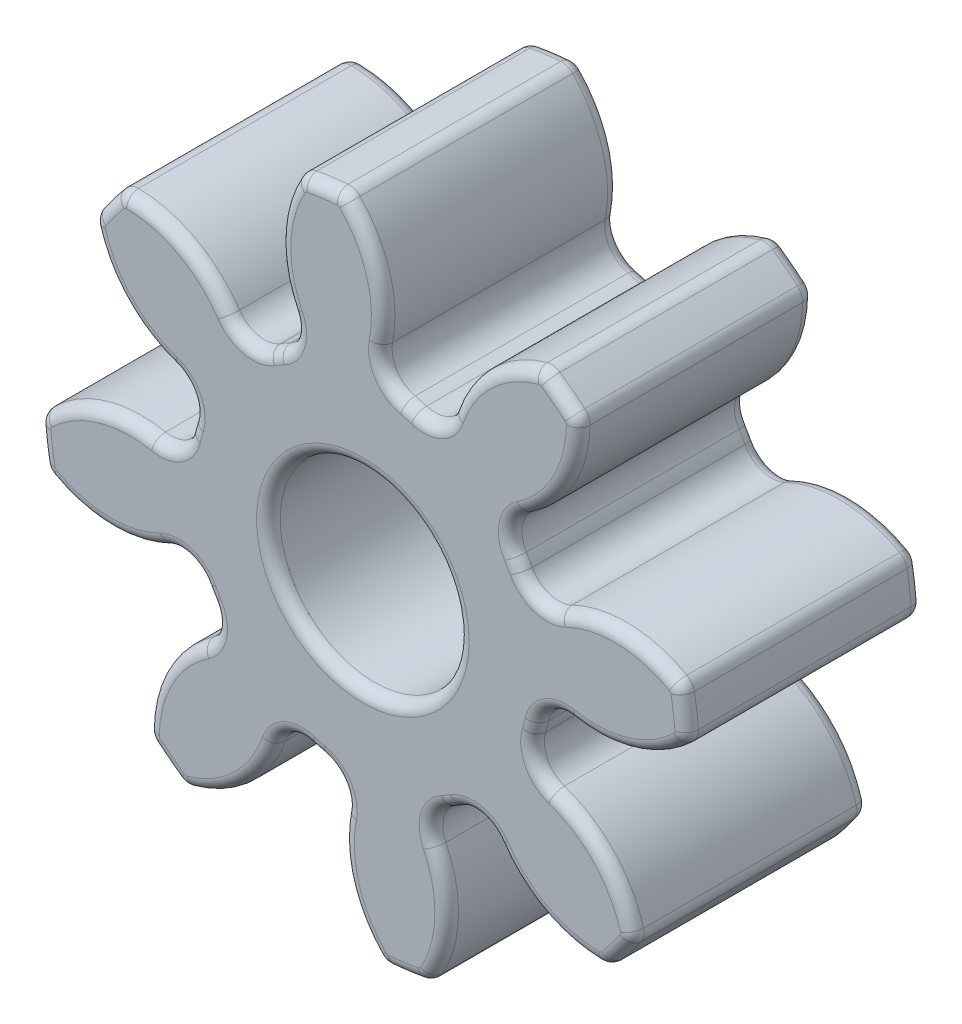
from build123d import *

# Parameters (mm, degrees)
EXTRUDE_1_DEPTH          = 5
PATTERN_CIRCULAR_1_COUNT = 8
SKETCH_6_R               = 7.5625
SKETCH_6_R_2             = 4
EXTRUDE_2_DEPTH          = 5
EXTRUDE_3_DEPTH          = 5
PATTERN_CIRCULAR_2_COUNT = 8
CUT_EXTRUDE_1_DEPTH      = 5
PATTERN_CIRCULAR_3_COUNT = 8
FILLET_1_R               = 0.5


with BuildPart() as part:
    # Sketch 4 → Extrude 1 (new, symmetric)
    with BuildSketch(Plane.XY):
        with BuildLine():
            ThreePointArc((-0.83713526, 13.724492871), (-1.785764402, 13.633544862), (-2.725815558, 13.47710761))
            ThreePointArc((-2.725815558, 13.47710761), (-3.533626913, 10.269610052), (-2.260782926, 7.216665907))
            ThreePointArc((-2.260782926, 7.216665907), (-0.982170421, 7.498449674), (0.325881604, 7.555475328))
            ThreePointArc((0.325881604, 7.555475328), (0.769508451, 10.833248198), (-0.83713526, 13.724492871))
        make_face()
    extrude(amount=EXTRUDE_1_DEPTH, both=True)


with BuildPart() as pattern_circular_1_1:
    # Pattern Circular 1: pattern copy
    add(part.part.rotate(Axis((0, 0, 0), (0, 0, 1)), 1 * 360 / PATTERN_CIRCULAR_1_COUNT))


with BuildPart() as pattern_circular_1_2:
    # Pattern Circular 1: pattern copy
    add(part.part.rotate(Axis((0, 0, 0), (0, 0, 1)), 2 * 360 / PATTERN_CIRCULAR_1_COUNT))


with BuildPart() as pattern_circular_1_3:
    # Pattern Circular 1: pattern copy
    add(part.part.rotate(Axis((0, 0, 0), (0, 0, 1)), 3 * 360 / PATTERN_CIRCULAR_1_COUNT))


with BuildPart() as pattern_circular_1_4:
    # Pattern Circular 1: pattern copy
    add(part.part.rotate(Axis((0, 0, 0), (0, 0, 1)), 4 * 360 / PATTERN_CIRCULAR_1_COUNT))


with BuildPart() as pattern_circular_1_5:
    # Pattern Circular 1: pattern copy
    add(part.part.rotate(Axis((0, 0, 0), (0, 0, 1)), 5 * 360 / PATTERN_CIRCULAR_1_COUNT))


with BuildPart() as pattern_circular_1_6:
    # Pattern Circular 1: pattern copy
    add(part.part.rotate(Axis((0, 0, 0), (0, 0, 1)), 6 * 360 / PATTERN_CIRCULAR_1_COUNT))


with BuildPart() as pattern_circular_1_7:
    # Pattern Circular 1: pattern copy
    add(part.part.rotate(Axis((0, 0, 0), (0, 0, 1)), 7 * 360 / PATTERN_CIRCULAR_1_COUNT))


with BuildPart() as part_1:
    add(part.part)

    add(pattern_circular_1_1.part)  # Extrude 2 merges Pattern Circular 1_1

    add(pattern_circular_1_2.part)  # Extrude 2 merges Pattern Circular 1_2

    add(pattern_circular_1_3.part)  # Extrude 2 merges Pattern Circular 1_3

    add(pattern_circular_1_4.part)  # Extrude 2 merges Pattern Circular 1_4

    add(pattern_circular_1_5.part)  # Extrude 2 merges Pattern Circular 1_5

    add(pattern_circular_1_6.part)  # Extrude 2 merges Pattern Circular 1_6

    add(pattern_circular_1_7.part)  # Extrude 2 merges Pattern Circular 1_7
    # Sketch 6 → Extrude 2 (add, symmetric)
    with BuildSketch(Plane.XY):
        Circle(SKETCH_6_R)
        Circle(SKETCH_6_R_2, mode=Mode.SUBTRACT)
    extrude(amount=EXTRUDE_2_DEPTH, both=True)

    # Sketch 7 → Extrude 3 (add, symmetric)
    with BuildSketch(Plane.XY):
        with BuildLine():
            ThreePointArc((-2.260782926, 7.216665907), (-2.92171134, 6.975314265), (-3.557347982, 6.673580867))
            ThreePointArc((-3.557347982, 6.673580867), (-2.946423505, 7.403336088), (-3.014068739, 8.352649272))
            ThreePointArc((-3.014068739, 8.352649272), (-2.674493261, 7.76007768), (-2.260782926, 7.216665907))
        make_face()
        with BuildLine():
            ThreePointArc((-5.112094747, 5.572960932), (-5.375018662, 6.203297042), (-5.717635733, 6.794115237))
            ThreePointArc((-5.717635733, 6.794115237), (-4.930031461, 6.259839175), (-3.992367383, 6.422803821))
            ThreePointArc((-3.992367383, 6.422803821), (-4.572019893, 6.02395554), (-5.112094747, 5.572960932))
        make_face()
    extrude_3 = extrude(amount=EXTRUDE_3_DEPTH, both=True)

    # Pattern Circular 2: Extrude 3 ×8 about axis
    pattern_circular_2_axis = Axis((0, 0, 0), (0, 0, 1))
    for i in range(1, PATTERN_CIRCULAR_2_COUNT):
        add(extrude_3.rotate(pattern_circular_2_axis, i * 360 / PATTERN_CIRCULAR_2_COUNT))

    # Sketch 8 → Cut-Extrude 1 (cut, symmetric)
    with BuildSketch(Plane.XY):
        with BuildLine():
            ThreePointArc((-0.83713526, 13.724492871), (-0.982407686, 13.714859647), (-1.127569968, 13.703688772))
            ThreePointArc((-1.127569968, 13.703688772), (-0.852252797, 13.665291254), (-0.619718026, 13.512970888))
            ThreePointArc((-0.619718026, 13.512970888), (-0.726896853, 13.620304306), (-0.83713526, 13.724492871))
        make_face()
        with BuildLine():
            ThreePointArc((-2.725815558, 13.47710761), (-2.805501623, 13.348042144), (-2.881421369, 13.216725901))
            ThreePointArc((-2.881421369, 13.216725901), (-2.695960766, 13.42379661), (-2.439820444, 13.531806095))
            ThreePointArc((-2.439820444, 13.531806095), (-2.582962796, 13.505213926), (-2.725815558, 13.47710761))
        make_face()
    cut_extrude_1 = extrude(amount=CUT_EXTRUDE_1_DEPTH, both=True, mode=Mode.SUBTRACT)

    # Pattern Circular 3: Cut-Extrude 1 ×8 about axis
    pattern_circular_3_axis = Axis((0, 0, 0), (0, 0, 1))
    for i in range(1, PATTERN_CIRCULAR_3_COUNT):
        add(cut_extrude_1.rotate(pattern_circular_3_axis, i * 360 / PATTERN_CIRCULAR_3_COUNT), mode=Mode.SUBTRACT)

    # Fillet 1
    fillet_1_edges = [part_1.edges().sort_by_distance(p)[0] for p in [
        (-3.776939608, 6.551803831, -5),
        (-3.776939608, 6.551803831, 5),
        (-2.946423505, 7.403336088, -5),
        (-2.946423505, 7.403336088, 5),
        (-7.56974652, 8.481471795, -5),
        (-7.56974652, 8.481471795, 5),
        (-4.930031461, 6.259839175, -5),
        (-4.930031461, 6.259839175, 5),
        (1.962125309, 7.303524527, -5),
        (1.962125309, 7.303524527, 5),
        (3.15151311, 7.318385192, -5),
        (3.15151311, 7.318385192, 5),
        (0.644687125, 11.349925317, -5),
        (0.644687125, 11.349925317, 5),
        (0.940316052, 7.912433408, -5),
        (0.940316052, 7.912433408, 5),
        (6.551803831, 3.776939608, -5),
        (6.551803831, 3.776939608, 5),
        (7.403336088, 2.946423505, -5),
        (7.403336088, 2.946423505, 5),
        (-4, 0, -5),
        (8.481471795, 7.56974652, -5),
        (8.481471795, 7.56974652, 5),
        (6.259839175, 4.930031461, -5),
        (-4, 0, 5),
        (6.259839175, 4.930031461, 5),
        (7.303524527, -1.962125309, -5),
        (7.303524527, -1.962125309, 5),
        (7.318385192, -3.15151311, -5),
        (7.318385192, -3.15151311, 5),
        (11.349925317, -0.644687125, -5),
        (11.349925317, -0.644687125, 5),
        (7.912433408, -0.940316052, -5),
        (7.912433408, -0.940316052, 5),
        (3.776939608, -6.551803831, -5),
        (3.776939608, -6.551803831, 5),
        (2.946423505, -7.403336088, -5),
        (2.946423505, -7.403336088, 5),
        (7.56974652, -8.481471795, -5),
        (7.56974652, -8.481471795, 5),
        (4.930031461, -6.259839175, -5),
        (4.930031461, -6.259839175, 5),
        (-1.962125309, -7.303524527, -5),
        (-1.962125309, -7.303524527, 5),
        (-3.15151311, -7.318385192, -5),
        (-3.15151311, -7.318385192, 5),
        (-0.644687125, -11.349925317, -5),
        (-0.644687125, -11.349925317, 5),
        (-0.940316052, -7.912433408, -5),
        (-0.940316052, -7.912433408, 5),
        (-6.551803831, -3.776939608, -5),
        (-6.551803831, -3.776939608, 5),
        (-7.403336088, -2.946423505, -5),
        (-7.403336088, -2.946423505, 5),
        (-8.481471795, -7.56974652, -5),
        (-8.481471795, -7.56974652, 5),
        (-6.259839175, -4.930031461, -5),
        (-6.259839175, -4.930031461, 5),
        (-7.303524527, 1.962125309, -5),
        (-7.303524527, 1.962125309, 5),
        (-7.318385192, 3.15151311, -5),
        (-7.318385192, 3.15151311, 5),
        (-11.349925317, 0.644687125, -5),
        (-11.349925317, 0.644687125, 5),
        (-7.912433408, 0.940316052, -5),
        (-7.912433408, 0.940316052, 5),
        (-1.785764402, 13.633544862, -5),
        (-1.785764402, 13.633544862, 5),
        (-0.852252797, 13.665291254, -5),
        (-0.852252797, 13.665291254, 5),
        (-3.546085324, 10.801004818, -5),
        (-3.546085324, 10.801004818, 5),
        (-2.695960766, 13.42379661, -5),
        (-2.695960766, 13.42379661, 5),
        (8.377645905, 10.903098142, -5),
        (8.377645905, 10.903098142, 5),
        (9.06018638, 10.265453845, -5),
        (9.06018638, 10.265453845, 5),
        (5.130002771, 10.14492473, -5),
        (5.130002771, 10.14492473, 5),
        (7.585725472, 11.398389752, -5),
        (7.585725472, 11.398389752, 5),
        (13.633544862, 1.785764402, -5),
        (13.633544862, 1.785764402, 5),
        (13.665291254, 0.852252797, -5),
        (13.665291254, 0.852252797, 5),
        (10.801004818, 3.546085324, -5),
        (10.801004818, 3.546085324, 5),
        (13.42379661, 2.695960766, -5),
        (13.42379661, 2.695960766, 5),
        (10.903098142, -8.377645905, -5),
        (10.903098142, -8.377645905, 5),
        (10.265453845, -9.06018638, -5),
        (10.265453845, -9.06018638, 5),
        (10.14492473, -5.130002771, -5),
        (10.14492473, -5.130002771, 5),
        (11.398389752, -7.585725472, -5),
        (11.398389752, -7.585725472, 5),
        (1.785764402, -13.633544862, -5),
        (1.785764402, -13.633544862, 5),
        (0.852252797, -13.665291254, -5),
        (0.852252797, -13.665291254, 5),
        (3.546085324, -10.801004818, -5),
        (3.546085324, -10.801004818, 5),
        (2.695960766, -13.42379661, -5),
        (2.695960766, -13.42379661, 5),
        (-8.377645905, -10.903098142, -5),
        (-8.377645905, -10.903098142, 5),
        (-9.06018638, -10.265453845, -5),
        (-9.06018638, -10.265453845, 5),
        (-5.130002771, -10.14492473, -5),
        (-5.130002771, -10.14492473, 5),
        (-7.585725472, -11.398389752, -5),
        (-7.585725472, -11.398389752, 5),
        (-13.633544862, -1.785764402, -5),
        (-13.633544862, -1.785764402, 5),
        (-13.665291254, -0.852252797, -5),
        (-13.665291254, -0.852252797, 5),
        (-10.801004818, -3.546085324, -5),
        (-10.801004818, -3.546085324, 5),
        (-13.42379661, -2.695960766, -5),
        (-13.42379661, -2.695960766, 5),
        (-10.903098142, 8.377645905, -5),
        (-10.903098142, 8.377645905, 5),
        (-10.265453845, 9.06018638, -5),
        (-10.265453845, 9.06018638, 5),
        (-10.14492473, 5.130002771, -5),
        (-10.14492473, 5.130002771, 5),
        (-11.398389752, 7.585725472, -5),
        (-11.398389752, 7.585725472, 5),
    ]]
    fillet(fillet_1_edges, radius=FILLET_1_R)


solid = part_1.part
